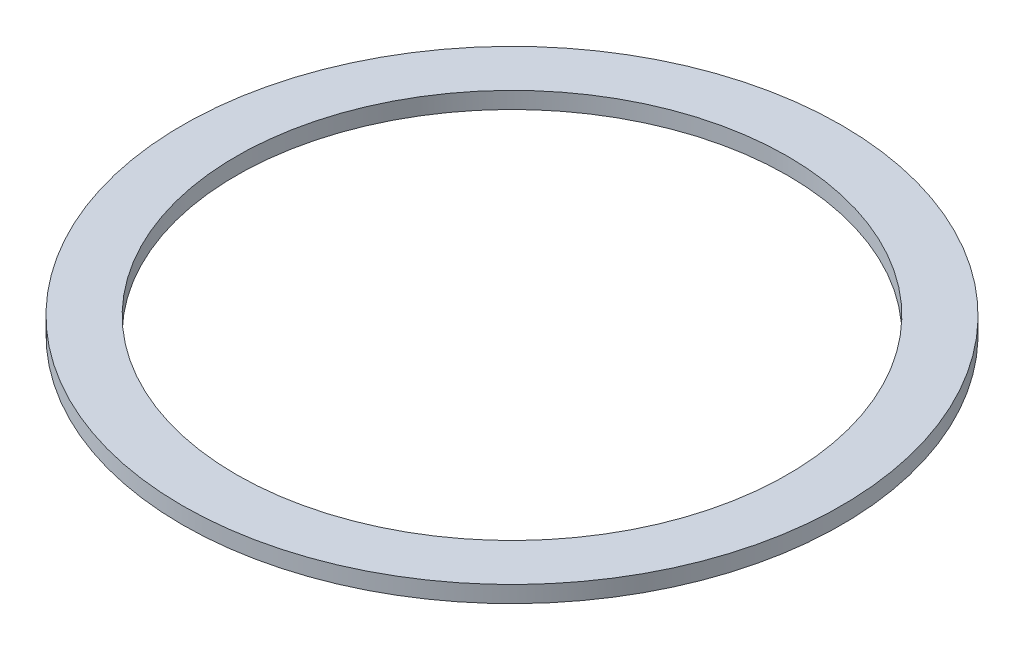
ISO-10303-21;
HEADER;
FILE_DESCRIPTION(('STEP AP214'),'2;1');
FILE_NAME('part.step','',(''),(''),'','','');
FILE_SCHEMA(('AUTOMOTIVE_DESIGN { 1 0 10303 214 1 1 1 1 }'));
ENDSEC;
DATA;
#1=APPLICATION_CONTEXT('core data for automotive mechanical design processes');
#2=APPLICATION_PROTOCOL_DEFINITION('international standard','automotive_design',2000,#1);
#3=PRODUCT_CONTEXT('',#1,'mechanical');
#4=PRODUCT('Part','Part','',(#3));
#5=PRODUCT_RELATED_PRODUCT_CATEGORY('part','',(#4));
#6=PRODUCT_DEFINITION_FORMATION('','',#4);
#7=PRODUCT_DEFINITION_CONTEXT('part definition',#1,'design');
#8=PRODUCT_DEFINITION('design','',#6,#7);
#9=PRODUCT_DEFINITION_SHAPE('','',#8);
#10=(LENGTH_UNIT() NAMED_UNIT(*) SI_UNIT(.MILLI.,.METRE.));
#11=(NAMED_UNIT(*) PLANE_ANGLE_UNIT() SI_UNIT($,.RADIAN.));
#12=(NAMED_UNIT(*) SI_UNIT($,.STERADIAN.) SOLID_ANGLE_UNIT());
#13=UNCERTAINTY_MEASURE_WITH_UNIT(LENGTH_MEASURE(1.E-05),#10,'distance_accuracy_value','');
#14=(GEOMETRIC_REPRESENTATION_CONTEXT(3) GLOBAL_UNCERTAINTY_ASSIGNED_CONTEXT((#13)) GLOBAL_UNIT_ASSIGNED_CONTEXT((#10,
#11,#12)) REPRESENTATION_CONTEXT('',''));
#15=CARTESIAN_POINT('',(0.,0.,0.));
#16=DIRECTION('',(0.,0.,1.));
#17=DIRECTION('',(1.,0.,0.));
#18=AXIS2_PLACEMENT_3D('',#15,#16,#17);
#19=CARTESIAN_POINT('',(0.,-10.,0.));
#20=DIRECTION('',(0.,-1.,0.));
#21=DIRECTION('',(0.,0.,-1.));
#22=AXIS2_PLACEMENT_3D('',#19,#20,#21);
#23=CYLINDRICAL_SURFACE('',#22,133.);
#24=CARTESIAN_POINT('',(0.,0.,0.));
#25=DIRECTION('',(0.,-1.,0.));
#26=DIRECTION('',(0.,0.,-1.));
#27=AXIS2_PLACEMENT_3D('',#24,#25,#26);
#28=CIRCLE('',#27,133.);
#29=CARTESIAN_POINT('',(0.,0.,-133.));
#30=VERTEX_POINT('',#29);
#31=EDGE_CURVE('E10',#30,#30,#28,.T.);
#32=ORIENTED_EDGE('',*,*,#31,.T.);
#33=EDGE_LOOP('',(#32));
#34=FACE_BOUND('',#33,.T.);
#35=CARTESIAN_POINT('',(0.,8.,0.));
#36=DIRECTION('',(0.,-1.,0.));
#37=DIRECTION('',(0.,0.,-1.));
#38=AXIS2_PLACEMENT_3D('',#35,#36,#37);
#39=CIRCLE('',#38,133.);
#40=CARTESIAN_POINT('',(0.,8.,-133.));
#41=VERTEX_POINT('',#40);
#42=EDGE_CURVE('E51',#41,#41,#39,.T.);
#43=ORIENTED_EDGE('',*,*,#42,.F.);
#44=EDGE_LOOP('',(#43));
#45=FACE_BOUND('',#44,.T.);
#46=ADVANCED_FACE('F40',(#34,#45),#23,.F.);
#47=CARTESIAN_POINT('',(133.,0.,0.));
#48=DIRECTION('',(0.,-1.,0.));
#49=DIRECTION('',(0.,0.,-1.));
#50=AXIS2_PLACEMENT_3D('',#47,#48,#49);
#51=PLANE('',#50);
#52=CARTESIAN_POINT('',(0.,0.,0.));
#53=DIRECTION('',(0.,-1.,0.));
#54=DIRECTION('',(0.,0.,-1.));
#55=AXIS2_PLACEMENT_3D('',#52,#53,#54);
#56=CIRCLE('',#55,159.);
#57=CARTESIAN_POINT('',(0.,0.,-159.));
#58=VERTEX_POINT('',#57);
#59=EDGE_CURVE('E43',#58,#58,#56,.T.);
#60=ORIENTED_EDGE('',*,*,#59,.T.);
#61=EDGE_LOOP('',(#60));
#62=FACE_BOUND('',#61,.T.);
#63=ORIENTED_EDGE('',*,*,#31,.F.);
#64=EDGE_LOOP('',(#63));
#65=FACE_BOUND('',#64,.T.);
#66=ADVANCED_FACE('F61',(#62,#65),#51,.T.);
#67=CARTESIAN_POINT('',(0.,-10.,0.));
#68=DIRECTION('',(0.,-1.,0.));
#69=DIRECTION('',(0.,0.,-1.));
#70=AXIS2_PLACEMENT_3D('',#67,#68,#69);
#71=CYLINDRICAL_SURFACE('',#70,159.);
#72=CARTESIAN_POINT('',(0.,8.,0.));
#73=DIRECTION('',(0.,-1.,0.));
#74=DIRECTION('',(0.,0.,-1.));
#75=AXIS2_PLACEMENT_3D('',#72,#73,#74);
#76=CIRCLE('',#75,159.);
#77=CARTESIAN_POINT('',(0.,8.,-159.));
#78=VERTEX_POINT('',#77);
#79=EDGE_CURVE('E50',#78,#78,#76,.T.);
#80=ORIENTED_EDGE('',*,*,#79,.T.);
#81=EDGE_LOOP('',(#80));
#82=FACE_BOUND('',#81,.T.);
#83=ORIENTED_EDGE('',*,*,#59,.F.);
#84=EDGE_LOOP('',(#83));
#85=FACE_BOUND('',#84,.T.);
#86=ADVANCED_FACE('F65',(#82,#85),#71,.T.);
#87=CARTESIAN_POINT('',(159.,8.,0.));
#88=DIRECTION('',(0.,1.,0.));
#89=DIRECTION('',(0.,0.,1.));
#90=AXIS2_PLACEMENT_3D('',#87,#88,#89);
#91=PLANE('',#90);
#92=ORIENTED_EDGE('',*,*,#42,.T.);
#93=EDGE_LOOP('',(#92));
#94=FACE_BOUND('',#93,.T.);
#95=ORIENTED_EDGE('',*,*,#79,.F.);
#96=EDGE_LOOP('',(#95));
#97=FACE_BOUND('',#96,.T.);
#98=ADVANCED_FACE('F60',(#94,#97),#91,.T.);
#99=CLOSED_SHELL('',(#46,#66,#86,#98));
#100=MANIFOLD_SOLID_BREP('B2',#99);
#101=ADVANCED_BREP_SHAPE_REPRESENTATION('',(#18,#100),#14);
#102=SHAPE_DEFINITION_REPRESENTATION(#9,#101);
ENDSEC;
END-ISO-10303-21;
